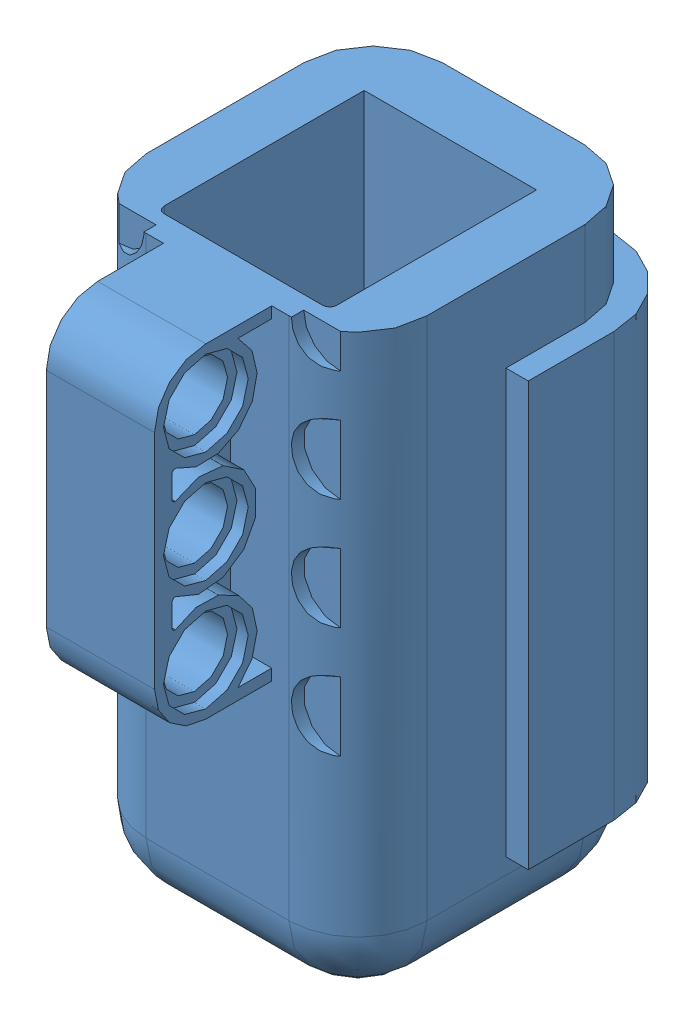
SolidWorks assembly Assem3.sldasm, configuration Default (file format 3100). Lengths in mm.
Overall size (24.05 48.07 31.6).
2 component instances, 2 part files, 3 mates.
Components (placement in the parent):
- sensor_touch_body-1: sensor_touch_body.SLDPRT [Default] at (1.3706 4.2091 -3.5828) size (24.05 45.24 31.6)
- sensor_touch_button-1: sensor_touch_button.SLDPRT [Default] at (1.3706 -12.2909 -3.5828) x (0.003259 0 -0.999995) z (-0.999995 0 -0.003259) size (16.15 9.9 16.15)
Mates (geometry in assembly coordinates):
- Distance1: distance = 5 mm anti-aligned: plane of sensor_touch_body-1; plane of sensor_touch_button-1
- Concentric1: concentric anti-aligned: cylinder of sensor_touch_body-1; cylinder of sensor_touch_button-1
- Coincident2: coincident: point of sensor_touch_body-1; plane of sensor_touch_button-1
